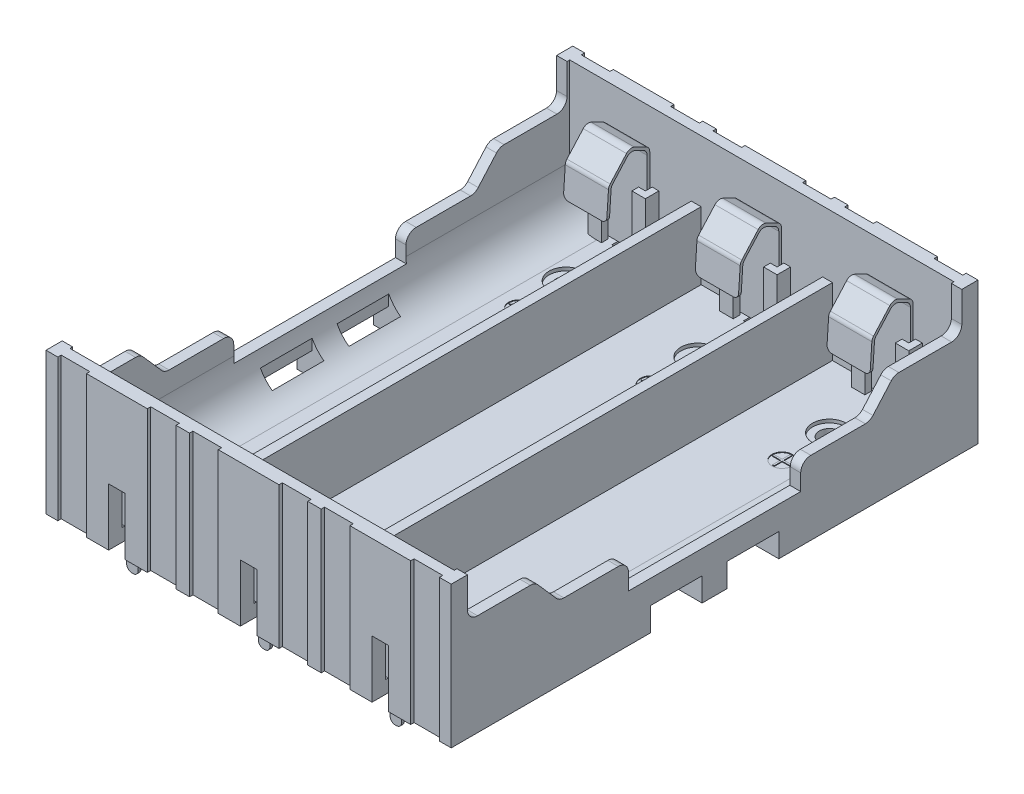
from build123d import *

# Parameters (mm, degrees)
SKETCH_1_W                      = 60
SKETCH_1_H                      = 78
EXTRUDE_5813_DEPTH              = 21
CUT_EXTRUDE_6805_DEPTH          = 54.4976635
SKETCH_3_W                      = 18
SKETCH_3_H                      = 74
CUT_EXTRUDE_7162_DEPTH          = 19.1
FILLET_1_R                      = 6
CUT_EXTRUDE_7564_DEPTH          = 15
CUT_EXTRUDE_7564_DEPTH_BACK     = 15
SKETCH_4_W                      = 74
SKETCH_4_H                      = 18.2
CUT_EXTRUDE_8107_DEPTH          = 15
FILLET_2_R                      = 1.5
FILLET_2_OF_MIRROR_2_R          = 1.5
SKETCH_6_W                      = 2.45
SKETCH_6_H                      = 7
CUT_EXTRUDE_9220_DEPTH          = 8.5
SKETCH_7_W                      = 3.4
SKETCH_7_H                      = 26.05
SKETCH_7_H_2                    = 2.75
CUT_EXTRUDE_9385_DEPTH          = 1
CUT_EXTRUDE_9_REACH             = 55.498
CUT_EXTRUDE_9_DIRECTION_2_REACH = 55.498
CUT_EXTRUDE_START               = -10.8
CUT_EXTRUDE_10_DEPTH            = 26.05
CUT_EXTRUDE_START_2             = 36.85
CUT_EXTRUDE_11_DEPTH            = 26.05
SKETCH_9_W                      = 8
SKETCH_9_H                      = 7.65
CUT_EXTRUDE_11498_DEPTH         = 3.5
SKETCH_10_W                     = 1.75
SKETCH_10_H                     = 7.65
CUT_EXTRUDE_15_DEPTH            = 54.4976635
SKETCH_11_R                     = 1.5
CUT_EXTRUDE_12349_DEPTH         = 54.4976635
EXTRUDE_START                   = -0.3
SKETCH_12_R                     = 2.8
SKETCH_12_R_2                   = 1.5
EXTRUDE_12812_DEPTH             = 0.3
CUT_EXTRUDE_START_3             = -0.5
SKETCH_13_R                     = 2.5
SKETCH_13_R_2                   = 1.5
CUT_EXTRUDE_17_DEPTH            = 0.5
SKETCH_14_R                     = 1.5
SKETCH_14_W                     = 0.25
SKETCH_14_H                     = 2.6
CUT_EXTRUDE_15667_DEPTH         = 0.1
EXTRUDE_16753_DEPTH             = 8.9
EXTRUDE_17294_DEPTH             = 3.2
SKETCH_17_W                     = 1.7
SKETCH_17_H                     = 0.4
EXTRUDE_17728_DEPTH             = 5.5
FILLET_3_R                      = 1
FILLET_4_R                      = 0.75
PATTERN_LINEAR_1_COUNT          = 3
PATTERN_LINEAR_1_PITCH          = 19.5


with BuildPart() as part:
    # Sketch 1 → Extrude 5813 (new body)
    with BuildSketch(Plane(origin=(0, 0, 0), x_dir=(1, 0, 0), z_dir=(0, 1, 0))):
        Rectangle(SKETCH_1_W, SKETCH_1_H)
    extrude(amount=EXTRUDE_5813_DEPTH)

    # Sketch 2 → Cut-Extrude 6805 (cut, through all)
    with BuildSketch(Plane(origin=(0, 0, 0), x_dir=(1, 0, 0), z_dir=(0, 1, 0))):
        Polygon((0, 49.757161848), (0, 39), (4.5, 39), (4.5, 38.5), (8.75, 38.5), (8.75, 39), (10.75, 39), (10.75, 38.5), (15, 38.5), (15, 39), (24, 39), (24, 38.5), (28.25, 38.5), (28.25, 39), (30, 39), (30, 49.757161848), align=None)
        Polygon((-4.5, 38.5), (-4.5, 39), (0, 39), (0, 49.757161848), (-30, 49.757161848), (-30, 39), (-28.25, 39), (-28.25, 38.5), (-24, 38.5), (-24, 39), (-15, 39), (-15, 38.5), (-10.75, 38.5), (-10.75, 39), (-8.75, 39), (-8.75, 38.5), align=None)
    cut_extrude_6805 = extrude(amount=CUT_EXTRUDE_6805_DEPTH, mode=Mode.SUBTRACT)

    # Mirror 1: Cut-Extrude 6805 across plane
    add(cut_extrude_6805.mirror(Plane.XY), mode=Mode.SUBTRACT)

    # Sketch 3 → Cut-Extrude 7162 (cut)
    with BuildSketch(Plane(origin=(0, 21, 0), x_dir=(1, 0, 0), z_dir=(0, 1, 0))):
        Rectangle(SKETCH_3_W, SKETCH_3_H)
        with Locations((-19.45, 0)):
            Rectangle(SKETCH_3_W, SKETCH_3_H)
        with Locations((19.45, 0)):
            Rectangle(SKETCH_3_W, SKETCH_3_H)
    extrude(amount=-CUT_EXTRUDE_7162_DEPTH, mode=Mode.SUBTRACT)

    # Fillet 1
    fillet_1_edges = [part.edges().sort_by_distance(p)[0] for p in [
        (28.45, 1.9, 0),
        (-28.45, 1.9, 0),
    ]]
    fillet(fillet_1_edges, radius=FILLET_1_R)

    # Sketch 4 → Cut-Extrude 7564 (cut, two sides: drawn at the far end of the back side and taken through both)
    with BuildSketch(Plane(origin=(0, 0, 0), x_dir=(0, 0, -1), z_dir=(1, 0, 0)).offset(-CUT_EXTRUDE_7564_DEPTH_BACK)):
        with Locations((0, 21)):
            Rectangle(SKETCH_4_W, SKETCH_4_H)
    extrude(amount=CUT_EXTRUDE_7564_DEPTH + CUT_EXTRUDE_7564_DEPTH_BACK, mode=Mode.SUBTRACT)

    # Sketch 5 → Cut-Extrude 8107 (cut)
    with BuildSketch(Plane(origin=(30, 0, 0), x_dir=(0, 0, -1), z_dir=(1, 0, 0))):
        Polygon((36.6, 21), (-36.6, 21), (-36.6, 15), (-26.6, 15), (-23, 10.9), (-12.75, 10.9), (-12.75, 7), (12.75, 7), (12.75, 10.9), (23, 10.9), (26.6, 15), (36.6, 15), align=None)
    cut_extrude_8107 = extrude(amount=-CUT_EXTRUDE_8107_DEPTH, mode=Mode.SUBTRACT)

    # Fillet 2
    fillet_2_edges = [part.edges().sort_by_distance(p)[0] for p in [
        (29.225, 15, -36.6),
        (29.225, 15, -26.6),
        (29.225, 10.9, -23),
        (29.225, 10.9, 12.75),
        (29.225, 10.9, 23),
        (29.225, 15, 26.6),
        (29.225, 15, 36.6),
        (29.225, 10.9, -12.75),
    ]]
    fillet(fillet_2_edges, radius=FILLET_2_R)

    # Mirror 2: Cut-Extrude 8107 across plane
    add(cut_extrude_8107.mirror(Plane(origin=(0, 0, 0), x_dir=(0, 0, 1), z_dir=(1, 0, 0))), mode=Mode.SUBTRACT)

    # Fillet 2 of Mirror 2
    fillet_2_of_mirror_2_edges = [part.edges().sort_by_distance(p)[0] for p in [
        (-29.225, 15, -36.6),
        (-29.225, 15, -26.6),
        (-29.225, 10.9, -23),
        (-29.225, 10.9, 12.75),
        (-29.225, 10.9, 23),
        (-29.225, 15, 26.6),
        (-29.225, 15, 36.6),
        (-29.225, 10.9, -12.75),
    ]]
    fillet(fillet_2_of_mirror_2_edges, radius=FILLET_2_OF_MIRROR_2_R)

    # Sketch 6 → Cut-Extrude 9220 (cut)
    with BuildSketch(Plane(origin=(0, 0, 0), x_dir=(1, 0, 0), z_dir=(0, 1, 0))):
        with Locations((0, -39)):
            Rectangle(SKETCH_6_W, SKETCH_6_H)
        with Locations((-19.5, -39)):
            Rectangle(SKETCH_6_W, SKETCH_6_H)
        with Locations((19.5, -39)):
            Rectangle(SKETCH_6_W, SKETCH_6_H)
        with Locations((19.5, 39)):
            Rectangle(SKETCH_6_W, SKETCH_6_H)
        with Locations((-19.5, 39)):
            Rectangle(SKETCH_6_W, SKETCH_6_H)
        with Locations((0, 39)):
            Rectangle(SKETCH_6_W, SKETCH_6_H)
    extrude(amount=CUT_EXTRUDE_9220_DEPTH, mode=Mode.SUBTRACT)

    # Sketch 7 → Cut-Extrude 9385 (cut)
    with BuildSketch(Plane(origin=(0, 0, 0), x_dir=(1, 0, 0), z_dir=(0, 1, 0))):
        with Locations((-26.025, -23.825)):
            Rectangle(SKETCH_7_W, SKETCH_7_H)
        with Locations((-26.025, 23.825)):
            Rectangle(SKETCH_7_W, SKETCH_7_H)
        with Locations((-26.025, 0)):
            Rectangle(SKETCH_7_W, SKETCH_7_H_2)
        with Locations((26.025, 23.825)):
            Rectangle(SKETCH_7_W, SKETCH_7_H)
        with Locations((26.025, -23.825)):
            Rectangle(SKETCH_7_W, SKETCH_7_H)
        with Locations((26.025, 0)):
            Rectangle(SKETCH_7_W, SKETCH_7_H_2)
    extrude(amount=CUT_EXTRUDE_9385_DEPTH, mode=Mode.SUBTRACT)

    # Cut-Extrude 9: up to this face of the body (flat: up to its plane)
    cut_extrude_9_end = Plane(part.part.faces().sort_by_distance((26.025, 0.5, -1.375))[0])
    # Sketch 8 → Cut-Extrude 9 (cut, up to the picked face)
    with BuildSketch(Plane.XY, mode=Mode.PRIVATE) as cut_extrude_9_sk1:
        with BuildLine():
            Line((24.325, 1), (27.725, 1))
            Line((27.725, 1), (27.725, 3.072992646))
            ThreePointArc((27.725, 3.072992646), (26.172223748, 1.795028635), (24.325, 1))
        make_face()
    cut_extrude_9_tool1 = split(extrude(cut_extrude_9_sk1.sketch, amount=-CUT_EXTRUDE_9_REACH, mode=Mode.PRIVATE), bisect_by=cut_extrude_9_end, keep=Keep.BOTH, mode=Mode.PRIVATE)
    cut_extrude_9 = cut_extrude_9_tool1.solids().sort_by(Axis((26.729809, 1.623312, 0), (0, 0, -1)))[0]
    add(cut_extrude_9, mode=Mode.SUBTRACT)

    # Cut-Extrude 9 direction 2: up to this face of the body (flat: up to its plane)
    cut_extrude_9_direction_2_end = Plane(part.part.faces().sort_by_distance((26.025, 0.5, 1.375))[0])
    # Sketch 8 → Cut-Extrude 9 direction 2 (cut, up to the picked face)
    with BuildSketch(Plane.XY, mode=Mode.PRIVATE) as cut_extrude_9_direction_2_sk1:
        with BuildLine():
            Line((24.325, 1), (27.725, 1))
            Line((27.725, 1), (27.725, 3.072992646))
            ThreePointArc((27.725, 3.072992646), (26.172223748, 1.795028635), (24.325, 1))
        make_face()
    cut_extrude_9_direction_2_tool1 = split(extrude(cut_extrude_9_direction_2_sk1.sketch, amount=CUT_EXTRUDE_9_DIRECTION_2_REACH, mode=Mode.PRIVATE), bisect_by=cut_extrude_9_direction_2_end, keep=Keep.BOTH, mode=Mode.PRIVATE)
    cut_extrude_9_direction_2 = cut_extrude_9_direction_2_tool1.solids().sort_by(Axis((26.729809, 1.623312, 0), (0, 0, 1)))[0]
    add(cut_extrude_9_direction_2, mode=Mode.SUBTRACT)

    # Sketch 8_3 → Cut-Extrude 10 (cut)
    with BuildSketch(Plane.XY.offset(CUT_EXTRUDE_START)):
        with BuildLine():
            ThreePointArc((24.325, 1), (26.172223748, 1.795028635), (27.725, 3.072992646))
            Line((27.725, 3.072992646), (27.725, 1))
            Line((27.725, 1), (24.325, 1))
        make_face()
    cut_extrude_10 = extrude(amount=-CUT_EXTRUDE_10_DEPTH, mode=Mode.SUBTRACT)

    # Sketch 8_4 → Cut-Extrude 11 (cut)
    with BuildSketch(Plane.XY.offset(CUT_EXTRUDE_START_2)):
        with BuildLine():
            Line((24.325, 1), (27.725, 1))
            Line((27.725, 1), (27.725, 3.072992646))
            ThreePointArc((27.725, 3.072992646), (26.172223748, 1.795028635), (24.325, 1))
        make_face()
    cut_extrude_11 = extrude(amount=-CUT_EXTRUDE_11_DEPTH, mode=Mode.SUBTRACT)

    # Mirror 3: Cut-Extrude 9, Cut-Extrude 9 direction 2, Cut-Extrude 10, Cut-Extrude 11 across plane
    add(cut_extrude_9.mirror(Plane(origin=(0, 0, 0), x_dir=(0, 0, 1), z_dir=(1, 0, 0))), mode=Mode.SUBTRACT)
    add(cut_extrude_9_direction_2.mirror(Plane(origin=(0, 0, 0), x_dir=(0, 0, 1), z_dir=(1, 0, 0))), mode=Mode.SUBTRACT)
    add(cut_extrude_10.mirror(Plane(origin=(0, 0, 0), x_dir=(0, 0, 1), z_dir=(1, 0, 0))), mode=Mode.SUBTRACT)
    add(cut_extrude_11.mirror(Plane(origin=(0, 0, 0), x_dir=(0, 0, 1), z_dir=(1, 0, 0))), mode=Mode.SUBTRACT)

    # Sketch 9 → Cut-Extrude 11498 (cut)
    with BuildSketch(Plane(origin=(0, 0, 0), x_dir=(1, 0, 0), z_dir=(0, 1, 0))):
        with Locations((-30, -5.675)):
            Rectangle(SKETCH_9_W, SKETCH_9_H)
        with Locations((-30, 5.675)):
            Rectangle(SKETCH_9_W, SKETCH_9_H)
        with Locations((30, 5.675)):
            Rectangle(SKETCH_9_W, SKETCH_9_H)
        with Locations((30, -5.675)):
            Rectangle(SKETCH_9_W, SKETCH_9_H)
    extrude(amount=CUT_EXTRUDE_11498_DEPTH, mode=Mode.SUBTRACT)

    # Sketch 10 → Cut-Extrude 15 (cut, through all)
    with BuildSketch(Plane(origin=(0, 0, 0), x_dir=(1, 0, 0), z_dir=(0, 1, 0))):
        with Locations((26.875, 5.675)):
            Rectangle(SKETCH_10_W, SKETCH_10_H)
        with Locations((-26.875, -5.675)):
            Rectangle(SKETCH_10_W, SKETCH_10_H)
        with Locations((-26.875, 5.675)):
            Rectangle(SKETCH_10_W, SKETCH_10_H)
        with Locations((26.875, -5.675)):
            Rectangle(SKETCH_10_W, SKETCH_10_H)
    extrude(amount=CUT_EXTRUDE_15_DEPTH, mode=Mode.SUBTRACT)

    # Sketch 11 → Cut-Extrude 12349 (cut, through all)
    with BuildSketch(Plane(origin=(0, 0, 0), x_dir=(1, 0, 0), z_dir=(0, 1, 0))):
        with Locations(Location((-19.5, 27.5, 0), (0, 0, 90))):
            Circle(SKETCH_11_R)
        with Locations(Location((0, 27.5, 0), (0, 0, 90))):
            Circle(SKETCH_11_R)
        with Locations(Location((19.5, 27.5, 0), (0, 0, 90))):
            Circle(SKETCH_11_R)
        with Locations(Location((19.5, -27.5, 0), (0, 0, 90))):
            Circle(SKETCH_11_R)
        with Locations(Location((0, -27.5, 0), (0, 0, 90))):
            Circle(SKETCH_11_R)
        with Locations(Location((-19.5, -27.5, 0), (0, 0, 90))):
            Circle(SKETCH_11_R)
    extrude(amount=CUT_EXTRUDE_12349_DEPTH, mode=Mode.SUBTRACT)

    # Sketch 12 → Extrude 12812 (add)
    # profile 1 of 6: a face of its own
    with BuildSketch(Plane(origin=(0, 0, 0), x_dir=(1, 0, 0), z_dir=(0, 1, 0)).offset(EXTRUDE_START)):
        with Locations(Location((-19.5, 27.5, 0), (0, 0, 270))):
            Circle(SKETCH_12_R)
        with Locations(Location((-19.5, 27.5, 0), (0, 0, 90))):
            Circle(SKETCH_12_R_2, mode=Mode.SUBTRACT)
    # profile 2 of 6: a face of its own
    with BuildSketch(Plane(origin=(0, 0, 0), x_dir=(1, 0, 0), z_dir=(0, 1, 0)).offset(EXTRUDE_START)):
        with Locations(Location((0, 27.5, 0), (0, 0, 270))):
            Circle(SKETCH_12_R)
        with Locations(Location((0, 27.5, 0), (0, 0, 90))):
            Circle(SKETCH_12_R_2, mode=Mode.SUBTRACT)
    # profile 3 of 6: a face of its own
    with BuildSketch(Plane(origin=(0, 0, 0), x_dir=(1, 0, 0), z_dir=(0, 1, 0)).offset(EXTRUDE_START)):
        with Locations(Location((19.5, 27.5, 0), (0, 0, 270))):
            Circle(SKETCH_12_R)
        with Locations(Location((19.5, 27.5, 0), (0, 0, 90))):
            Circle(SKETCH_12_R_2, mode=Mode.SUBTRACT)
    # profile 4 of 6: a face of its own
    with BuildSketch(Plane(origin=(0, 0, 0), x_dir=(1, 0, 0), z_dir=(0, 1, 0)).offset(EXTRUDE_START)):
        with Locations(Location((19.5, -27.5, 0), (0, 0, 270))):
            Circle(SKETCH_12_R)
        with Locations(Location((19.5, -27.5, 0), (0, 0, 90))):
            Circle(SKETCH_12_R_2, mode=Mode.SUBTRACT)
    # profile 5 of 6: a face of its own
    with BuildSketch(Plane(origin=(0, 0, 0), x_dir=(1, 0, 0), z_dir=(0, 1, 0)).offset(EXTRUDE_START)):
        with Locations(Location((0, -27.5, 0), (0, 0, 270))):
            Circle(SKETCH_12_R)
        with Locations(Location((0, -27.5, 0), (0, 0, 90))):
            Circle(SKETCH_12_R_2, mode=Mode.SUBTRACT)
    # profile 6 of 6: a face of its own
    with BuildSketch(Plane(origin=(0, 0, 0), x_dir=(1, 0, 0), z_dir=(0, 1, 0)).offset(EXTRUDE_START)):
        with Locations(Location((-19.5, -27.5, 0), (0, 0, 270))):
            Circle(SKETCH_12_R)
        with Locations(Location((-19.5, -27.5, 0), (0, 0, 90))):
            Circle(SKETCH_12_R_2, mode=Mode.SUBTRACT)
    extrude(amount=EXTRUDE_12812_DEPTH)

    # Sketch 13 → Cut-Extrude 17 (cut)
    # profile 1 of 6: a face of its own
    with BuildSketch(Plane(origin=(0, 1.9, 0), x_dir=(1, 0, 0), z_dir=(0, 1, 0)).offset(CUT_EXTRUDE_START_3)):
        with Locations(Location((-19.5, -27.5, 0), (0, 0, 270))):
            Circle(SKETCH_13_R)
        with Locations(Location((-19.5, -27.5, 0), (0, 0, 90))):
            Circle(SKETCH_13_R_2, mode=Mode.SUBTRACT)
    # profile 2 of 6: a face of its own
    with BuildSketch(Plane(origin=(0, 1.9, 0), x_dir=(1, 0, 0), z_dir=(0, 1, 0)).offset(CUT_EXTRUDE_START_3)):
        with Locations(Location((0, -27.5, 0), (0, 0, 270))):
            Circle(SKETCH_13_R)
        with Locations(Location((0, -27.5, 0), (0, 0, 90))):
            Circle(SKETCH_13_R_2, mode=Mode.SUBTRACT)
    # profile 3 of 6: a face of its own
    with BuildSketch(Plane(origin=(0, 1.9, 0), x_dir=(1, 0, 0), z_dir=(0, 1, 0)).offset(CUT_EXTRUDE_START_3)):
        with Locations(Location((19.5, 27.5, 0), (0, 0, 270))):
            Circle(SKETCH_13_R)
        with Locations(Location((19.5, 27.5, 0), (0, 0, 90))):
            Circle(SKETCH_13_R_2, mode=Mode.SUBTRACT)
    # profile 4 of 6: a face of its own
    with BuildSketch(Plane(origin=(0, 1.9, 0), x_dir=(1, 0, 0), z_dir=(0, 1, 0)).offset(CUT_EXTRUDE_START_3)):
        with Locations(Location((0, 27.5, 0), (0, 0, 270))):
            Circle(SKETCH_13_R)
        with Locations(Location((0, 27.5, 0), (0, 0, 90))):
            Circle(SKETCH_13_R_2, mode=Mode.SUBTRACT)
    # profile 5 of 6: a face of its own
    with BuildSketch(Plane(origin=(0, 1.9, 0), x_dir=(1, 0, 0), z_dir=(0, 1, 0)).offset(CUT_EXTRUDE_START_3)):
        with Locations(Location((-19.5, 27.5, 0), (0, 0, 270))):
            Circle(SKETCH_13_R)
        with Locations(Location((-19.5, 27.5, 0), (0, 0, 90))):
            Circle(SKETCH_13_R_2, mode=Mode.SUBTRACT)
    # profile 6 of 6: a face of its own
    with BuildSketch(Plane(origin=(0, 1.9, 0), x_dir=(1, 0, 0), z_dir=(0, 1, 0)).offset(CUT_EXTRUDE_START_3)):
        with Locations(Location((19.5, -27.5, 0), (0, 0, 270))):
            Circle(SKETCH_13_R)
        with Locations(Location((19.5, -27.5, 0), (0, 0, 90))):
            Circle(SKETCH_13_R_2, mode=Mode.SUBTRACT)
    extrude(amount=CUT_EXTRUDE_17_DEPTH, mode=Mode.SUBTRACT)

    # Sketch 14 → Cut-Extrude 15667 (cut)
    # profile 1 of 6: a face of its own
    with BuildSketch(Plane(origin=(0, 1.9, 0), x_dir=(1, 0, 0), z_dir=(0, 1, 0))):
        with Locations(Location((-19.5, 20.5, 0), (0, 0, 270))):
            Circle(SKETCH_14_R)
        Polygon((-19.625, 21.8), (-19.375, 21.8), (-19.375, 20.625), (-18.2, 20.625), (-18.2, 20.375), (-19.375, 20.375), (-19.375, 19.2), (-19.625, 19.2), (-19.625, 20.375), (-20.8, 20.375), (-20.8, 20.625), (-19.625, 20.625), align=None, mode=Mode.SUBTRACT)
    # profile 2 of 6: a face of its own
    with BuildSketch(Plane(origin=(0, 1.9, 0), x_dir=(1, 0, 0), z_dir=(0, 1, 0))):
        with Locations(Location((-19.5, -20.5, 0), (0, 0, 270))):
            Circle(SKETCH_14_R)
        with Locations((-19.5, -20.5)):
            Rectangle(SKETCH_14_W, SKETCH_14_H, mode=Mode.SUBTRACT)
    # profile 3 of 6: a face of its own
    with BuildSketch(Plane(origin=(0, 1.9, 0), x_dir=(1, 0, 0), z_dir=(0, 1, 0))):
        with Locations(Location((0, 20.5, 0), (0, 0, 270))):
            Circle(SKETCH_14_R)
        Polygon((-0.125, 21.8), (0.125, 21.8), (0.125, 20.625), (1.3, 20.625), (1.3, 20.375), (0.125, 20.375), (0.125, 19.2), (-0.125, 19.2), (-0.125, 20.375), (-1.3, 20.375), (-1.3, 20.625), (-0.125, 20.625), align=None, mode=Mode.SUBTRACT)
    # profile 4 of 6: a face of its own
    with BuildSketch(Plane(origin=(0, 1.9, 0), x_dir=(1, 0, 0), z_dir=(0, 1, 0))):
        with Locations(Location((0, -20.5, 0), (0, 0, 270))):
            Circle(SKETCH_14_R)
        with Locations((0, -20.5)):
            Rectangle(SKETCH_14_W, SKETCH_14_H, mode=Mode.SUBTRACT)
    # profile 5 of 6: a face of its own
    with BuildSketch(Plane(origin=(0, 1.9, 0), x_dir=(1, 0, 0), z_dir=(0, 1, 0))):
        with Locations(Location((19.5, 20.5, 0), (0, 0, 270))):
            Circle(SKETCH_14_R)
        Polygon((19.375, 21.8), (19.625, 21.8), (19.625, 20.625), (20.8, 20.625), (20.8, 20.375), (19.625, 20.375), (19.625, 19.2), (19.375, 19.2), (19.375, 20.375), (18.2, 20.375), (18.2, 20.625), (19.375, 20.625), align=None, mode=Mode.SUBTRACT)
    # profile 6 of 6: a face of its own
    with BuildSketch(Plane(origin=(0, 1.9, 0), x_dir=(1, 0, 0), z_dir=(0, 1, 0))):
        with Locations(Location((19.5, -20.5, 0), (0, 0, 270))):
            Circle(SKETCH_14_R)
        with Locations((19.5, -20.5)):
            Rectangle(SKETCH_14_W, SKETCH_14_H, mode=Mode.SUBTRACT)
    extrude(amount=-CUT_EXTRUDE_15667_DEPTH, mode=Mode.SUBTRACT)

    # Sketch 15 → Extrude 16753 (add)
    with BuildSketch(Plane(origin=(0, 1.9, 0), x_dir=(1, 0, 0), z_dir=(0, 1, 0))):
        Polygon((-21.75, 35), (-23.75, 35), (-23.75, 37), (-22.75, 37), (-22.75, 36), (-21.75, 36), align=None)
        Polygon((-17.25, 35), (-17.25, 36), (-16.25, 36), (-16.25, 37), (-15.25, 37), (-15.25, 35), align=None)
        Polygon((-2.25, 35), (-4.25, 35), (-4.25, 37), (-3.25, 37), (-3.25, 36), (-2.25, 36), align=None)
        Polygon((2.25, 35), (2.25, 36), (3.25, 36), (3.25, 37), (4.25, 37), (4.25, 35), align=None)
        Polygon((17.25, 35), (15.25, 35), (15.25, 37), (16.25, 37), (16.25, 36), (17.25, 36), align=None)
        Polygon((21.75, 35), (21.75, 36), (22.75, 36), (22.75, 37), (23.75, 37), (23.75, 35), align=None)
        Polygon((23.75, -35), (21.75, -35), (21.75, -36), (22.75, -36), (22.75, -37), (23.75, -37), align=None)
        Polygon((17.25, -36), (17.25, -35), (15.25, -35), (15.25, -37), (16.25, -37), (16.25, -36), align=None)
        Polygon((4.25, -35), (2.25, -35), (2.25, -36), (3.25, -36), (3.25, -37), (4.25, -37), align=None)
        Polygon((-2.25, -36), (-2.25, -35), (-4.25, -35), (-4.25, -37), (-3.25, -37), (-3.25, -36), align=None)
        Polygon((-15.25, -35), (-17.25, -35), (-17.25, -36), (-16.25, -36), (-16.25, -37), (-15.25, -37), align=None)
        Polygon((-21.75, -36), (-21.75, -35), (-23.75, -35), (-23.75, -37), (-22.75, -37), (-22.75, -36), align=None)
    extrude(amount=EXTRUDE_16753_DEPTH)


with BuildPart() as body_2:
    # Sketch 16 → Extrude 17294 (new, symmetric)
    with BuildSketch(Plane.ZY.offset(19.5)):
        Polygon((-36.3, 2), (-36.3, 15.826972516), (-33.848539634, 17.01426896), (-30.994965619, 13.823876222), (-30.699555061, 9.402575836), (-30.300444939, 9.429242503), (-30.605034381, 13.987919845), (-33.751460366, 17.50573104), (-36.7, 16.077688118), (-36.7, 2), align=None)
    extrude(amount=EXTRUDE_17294_DEPTH, both=True)

    # Sketch 17 → Extrude 17728 (add)
    with BuildSketch(Plane.XZ.offset(-2)):
        with Locations((-19.5, -36.5)):
            Rectangle(SKETCH_17_W, SKETCH_17_H)
    extrude(amount=EXTRUDE_17728_DEPTH)

    # Fillet 3
    fillet_3_edges = [body_2.edges().sort_by_distance(p)[0] for p in [
        (-19.5, 13.823876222, -30.994965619),
        (-19.5, 17.01426896, -33.848539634),
        (-19.5, 15.826972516, -36.3),
        (-19.5, 16.077688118, -36.7),
        (-19.5, 17.50573104, -33.751460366),
        (-19.5, 13.987919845, -30.605034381),
    ]]
    fillet(fillet_3_edges, radius=FILLET_3_R)

    # Fillet 4
    fillet_4_edges = [body_2.edges().sort_by_distance(p)[0] for p in [
        (-16.3, 9.41590917, -30.5),
        (-22.7, 2, -36.5),
        (-20.35, -3.5, -36.5),
        (-18.65, -3.5, -36.5),
        (-22.7, 9.41590917, -30.5),
        (-16.3, 2, -36.5),
    ]]
    fillet(fillet_4_edges, radius=FILLET_4_R)


with BuildPart() as pattern_linear_1_1:
    # Pattern Linear 1: pattern copy
    add(body_2.part.moved(Location(Vector(1, 0, 0) * (1 * PATTERN_LINEAR_1_PITCH))))


with BuildPart() as pattern_linear_1_2:
    # Pattern Linear 1: pattern copy
    add(body_2.part.moved(Location(Vector(1, 0, 0) * (2 * PATTERN_LINEAR_1_PITCH))))


with BuildPart() as body_5:
    # Mirror 4: mirrored copy
    add(pattern_linear_1_2.part.mirror(Plane.XY))


with BuildPart() as body_6:
    # Mirror 4 2: mirrored copy
    add(pattern_linear_1_1.part.mirror(Plane.XY))


with BuildPart() as body_7:
    # Mirror 4 3: mirrored copy
    add(body_2.part.mirror(Plane.XY))


solid = Compound([part.part, body_2.part, pattern_linear_1_1.part, pattern_linear_1_2.part, body_5.part, body_6.part, body_7.part])
